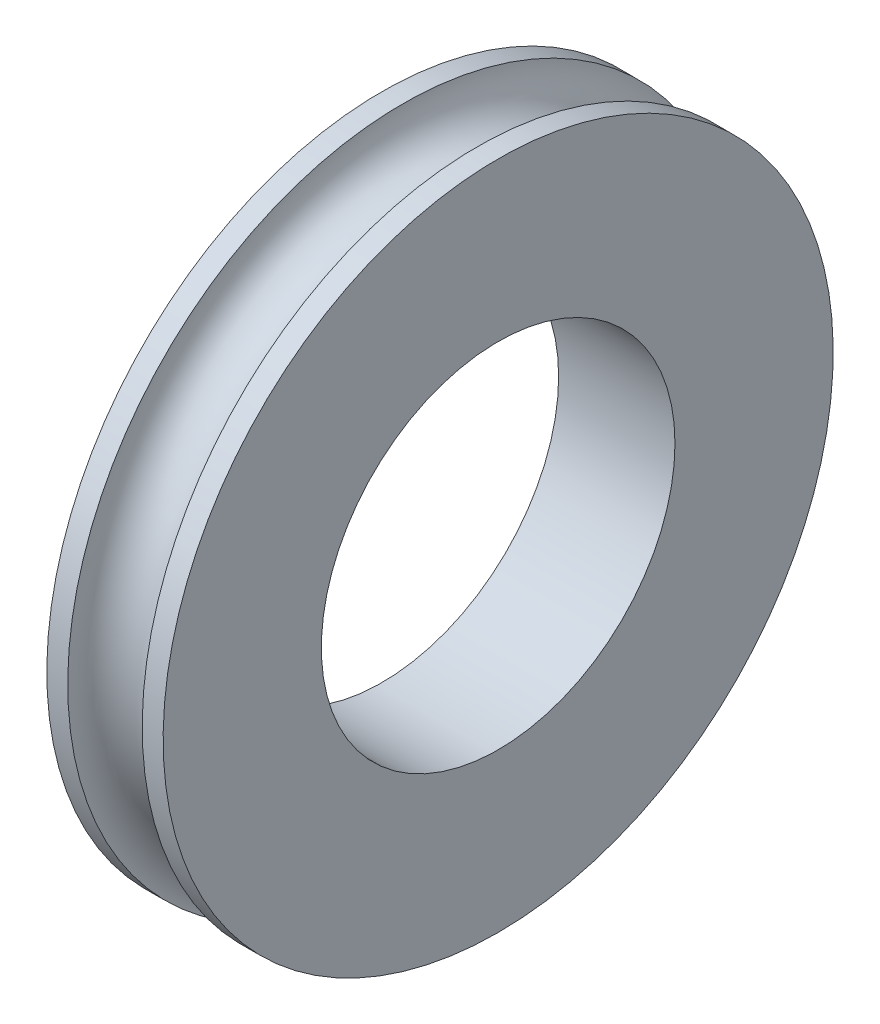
from build123d import *

# Parameters (mm, degrees)
F_19_0_19_DIAMETER_HOLE1_D = 19


with BuildPart() as part:
    # Sketch1 → Revolve1 (revolve)
    with BuildSketch(Plane.XY, mode=Mode.PRIVATE) as revolve1_sk:
        with BuildLine():
            Line((-3.125, 0), (3.125, 0))
            Line((3.125, 0), (3.125, 18))
            Line((3.125, 18), (2, 18))
            ThreePointArc((2, 18), (0, 16), (-2, 18))
            Line((-2, 18), (-3.125, 18))
            Line((-3.125, 18), (-3.125, 0))
        make_face()
    revolve(revolve1_sk.sketch.rotate(Axis((-22.996218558, 0, 0), (1, 0, 0)), 180), axis=Axis((-22.996218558, 0, 0), (1, 0, 0)))

    # 19.0 _19_ Diameter Hole1 (through all)
    with Locations(Plane(origin=(3.125, 0, 0), x_dir=(0, 0, -1), z_dir=(1, 0, 0))):
        with Locations((0, 0)):
            Hole(F_19_0_19_DIAMETER_HOLE1_D / 2)


solid = part.part
